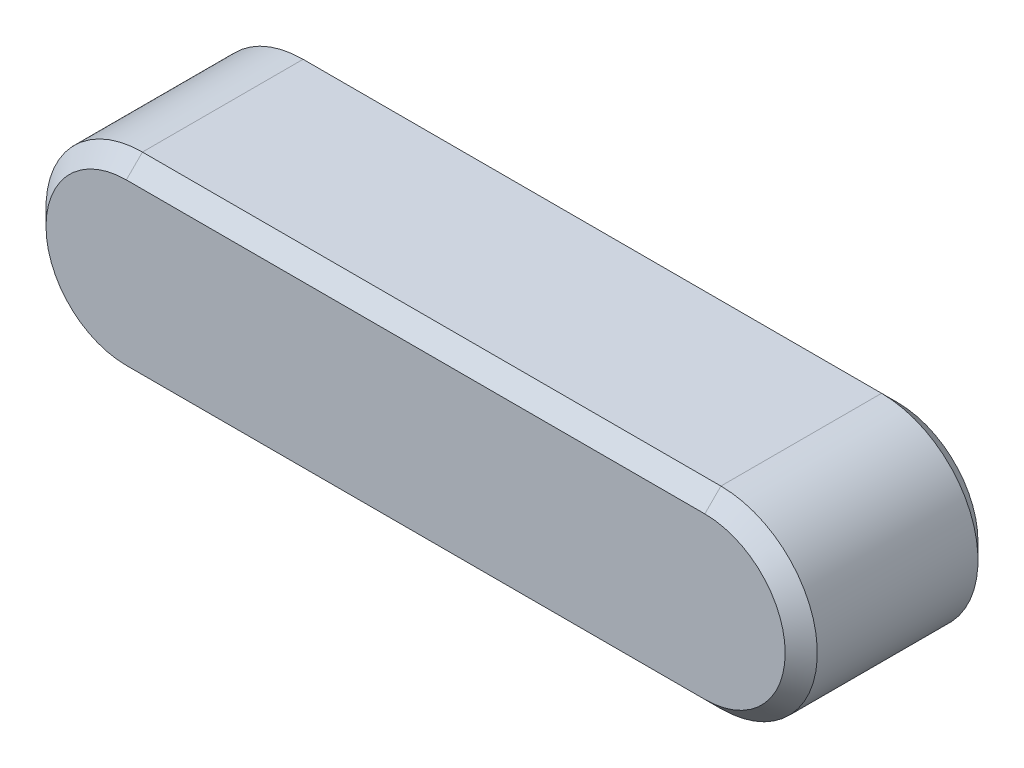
ISO-10303-21;
HEADER;
FILE_DESCRIPTION(('STEP AP214'),'2;1');
FILE_NAME('part.step','',(''),(''),'','','');
FILE_SCHEMA(('AUTOMOTIVE_DESIGN { 1 0 10303 214 1 1 1 1 }'));
ENDSEC;
DATA;
#1=APPLICATION_CONTEXT('core data for automotive mechanical design processes');
#2=APPLICATION_PROTOCOL_DEFINITION('international standard','automotive_design',2000,#1);
#3=PRODUCT_CONTEXT('',#1,'mechanical');
#4=PRODUCT('Part','Part','',(#3));
#5=PRODUCT_RELATED_PRODUCT_CATEGORY('part','',(#4));
#6=PRODUCT_DEFINITION_FORMATION('','',#4);
#7=PRODUCT_DEFINITION_CONTEXT('part definition',#1,'design');
#8=PRODUCT_DEFINITION('design','',#6,#7);
#9=PRODUCT_DEFINITION_SHAPE('','',#8);
#10=(LENGTH_UNIT() NAMED_UNIT(*) SI_UNIT(.MILLI.,.METRE.));
#11=(NAMED_UNIT(*) PLANE_ANGLE_UNIT() SI_UNIT($,.RADIAN.));
#12=(NAMED_UNIT(*) SI_UNIT($,.STERADIAN.) SOLID_ANGLE_UNIT());
#13=UNCERTAINTY_MEASURE_WITH_UNIT(LENGTH_MEASURE(1.E-05),#10,'distance_accuracy_value','');
#14=(GEOMETRIC_REPRESENTATION_CONTEXT(3) GLOBAL_UNCERTAINTY_ASSIGNED_CONTEXT((#13)) GLOBAL_UNIT_ASSIGNED_CONTEXT((#10,
#11,#12)) REPRESENTATION_CONTEXT('',''));
#15=CARTESIAN_POINT('',(0.,0.,0.));
#16=DIRECTION('',(0.,0.,1.));
#17=DIRECTION('',(1.,0.,0.));
#18=AXIS2_PLACEMENT_3D('',#15,#16,#17);
#19=CARTESIAN_POINT('',(-305.461782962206,426.327731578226,6.));
#20=DIRECTION('',(0.,0.,-1.));
#21=DIRECTION('',(-1.,0.,0.));
#22=AXIS2_PLACEMENT_3D('',#19,#20,#21);
#23=CYLINDRICAL_SURFACE('',#22,3.00000000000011);
#24=DIRECTION('',(0.,0.,-1.));
#25=VECTOR('',#24,1.);
#26=CARTESIAN_POINT('',(-305.461782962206,423.327731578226,6.));
#27=LINE('',#26,#25);
#28=CARTESIAN_POINT('',(-305.461782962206,423.327731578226,5.49999999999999));
#29=VERTEX_POINT('',#28);
#30=CARTESIAN_POINT('',(-305.461782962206,423.327731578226,0.499999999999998));
#31=VERTEX_POINT('',#30);
#32=EDGE_CURVE('E120',#29,#31,#27,.T.);
#33=ORIENTED_EDGE('',*,*,#32,.F.);
#34=CARTESIAN_POINT('',(-305.461782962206,426.327731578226,5.49999999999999));
#35=DIRECTION('',(0.,0.,1.));
#36=DIRECTION('',(1.,0.,0.));
#37=AXIS2_PLACEMENT_3D('',#34,#35,#36);
#38=CIRCLE('',#37,3.00000000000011);
#39=CARTESIAN_POINT('',(-305.461782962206,429.327731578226,5.49999999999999));
#40=VERTEX_POINT('',#39);
#41=EDGE_CURVE('E151',#29,#40,#38,.F.);
#42=ORIENTED_EDGE('',*,*,#41,.T.);
#43=DIRECTION('',(0.,0.,-1.));
#44=VECTOR('',#43,1.);
#45=CARTESIAN_POINT('',(-305.461782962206,429.327731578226,6.));
#46=LINE('',#45,#44);
#47=CARTESIAN_POINT('',(-305.461782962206,429.327731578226,0.499999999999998));
#48=VERTEX_POINT('',#47);
#49=EDGE_CURVE('E126',#40,#48,#46,.T.);
#50=ORIENTED_EDGE('',*,*,#49,.T.);
#51=CARTESIAN_POINT('',(-305.461782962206,426.327731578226,0.499999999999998));
#52=DIRECTION('',(0.,0.,1.));
#53=DIRECTION('',(1.,0.,0.));
#54=AXIS2_PLACEMENT_3D('',#51,#52,#53);
#55=CIRCLE('',#54,3.00000000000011);
#56=EDGE_CURVE('E153',#48,#31,#55,.T.);
#57=ORIENTED_EDGE('',*,*,#56,.T.);
#58=EDGE_LOOP('',(#33,#42,#50,#57));
#59=FACE_BOUND('',#58,.T.);
#60=ADVANCED_FACE('F32',(#59),#23,.T.);
#61=CARTESIAN_POINT('',(-287.461782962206,423.327731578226,6.));
#62=DIRECTION('',(0.,1.,0.));
#63=DIRECTION('',(0.,0.,1.));
#64=AXIS2_PLACEMENT_3D('',#61,#62,#63);
#65=PLANE('',#64);
#66=DIRECTION('',(0.,0.,-1.));
#67=VECTOR('',#66,1.);
#68=CARTESIAN_POINT('',(-287.461782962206,423.327731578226,6.));
#69=LINE('',#68,#67);
#70=CARTESIAN_POINT('',(-287.461782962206,423.327731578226,5.49999999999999));
#71=VERTEX_POINT('',#70);
#72=CARTESIAN_POINT('',(-287.461782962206,423.327731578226,0.499999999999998));
#73=VERTEX_POINT('',#72);
#74=EDGE_CURVE('E172',#71,#73,#69,.T.);
#75=ORIENTED_EDGE('',*,*,#74,.F.);
#76=DIRECTION('',(-1.,0.,0.));
#77=VECTOR('',#76,1.);
#78=CARTESIAN_POINT('',(-305.461782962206,423.327731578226,5.49999999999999));
#79=LINE('',#78,#77);
#80=EDGE_CURVE('E155',#71,#29,#79,.T.);
#81=ORIENTED_EDGE('',*,*,#80,.T.);
#82=ORIENTED_EDGE('',*,*,#32,.T.);
#83=DIRECTION('',(1.,0.,0.));
#84=VECTOR('',#83,1.);
#85=CARTESIAN_POINT('',(-287.461782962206,423.327731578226,0.499999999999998));
#86=LINE('',#85,#84);
#87=EDGE_CURVE('E157',#31,#73,#86,.T.);
#88=ORIENTED_EDGE('',*,*,#87,.T.);
#89=EDGE_LOOP('',(#75,#81,#82,#88));
#90=FACE_BOUND('',#89,.T.);
#91=ADVANCED_FACE('F189',(#90),#65,.F.);
#92=CARTESIAN_POINT('',(-287.461782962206,426.327731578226,6.));
#93=DIRECTION('',(0.,0.,-1.));
#94=DIRECTION('',(-1.,0.,0.));
#95=AXIS2_PLACEMENT_3D('',#92,#93,#94);
#96=CYLINDRICAL_SURFACE('',#95,3.00000000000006);
#97=DIRECTION('',(0.,0.,-1.));
#98=VECTOR('',#97,1.);
#99=CARTESIAN_POINT('',(-287.461782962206,429.327731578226,6.));
#100=LINE('',#99,#98);
#101=CARTESIAN_POINT('',(-287.461782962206,429.327731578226,5.49999999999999));
#102=VERTEX_POINT('',#101);
#103=CARTESIAN_POINT('',(-287.461782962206,429.327731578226,0.499999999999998));
#104=VERTEX_POINT('',#103);
#105=EDGE_CURVE('E175',#102,#104,#100,.T.);
#106=ORIENTED_EDGE('',*,*,#105,.F.);
#107=CARTESIAN_POINT('',(-287.461782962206,426.327731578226,5.49999999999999));
#108=DIRECTION('',(0.,0.,1.));
#109=DIRECTION('',(1.,0.,0.));
#110=AXIS2_PLACEMENT_3D('',#107,#108,#109);
#111=CIRCLE('',#110,3.00000000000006);
#112=EDGE_CURVE('E162',#102,#71,#111,.F.);
#113=ORIENTED_EDGE('',*,*,#112,.T.);
#114=ORIENTED_EDGE('',*,*,#74,.T.);
#115=CARTESIAN_POINT('',(-287.461782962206,426.327731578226,0.499999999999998));
#116=DIRECTION('',(0.,0.,1.));
#117=DIRECTION('',(1.,0.,0.));
#118=AXIS2_PLACEMENT_3D('',#115,#116,#117);
#119=CIRCLE('',#118,3.00000000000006);
#120=EDGE_CURVE('E165',#73,#104,#119,.T.);
#121=ORIENTED_EDGE('',*,*,#120,.T.);
#122=EDGE_LOOP('',(#106,#113,#114,#121));
#123=FACE_BOUND('',#122,.T.);
#124=ADVANCED_FACE('F192',(#123),#96,.T.);
#125=CARTESIAN_POINT('',(-305.461782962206,429.327731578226,6.));
#126=DIRECTION('',(0.,-1.,0.));
#127=DIRECTION('',(1.,0.,0.));
#128=AXIS2_PLACEMENT_3D('',#125,#126,#127);
#129=PLANE('',#128);
#130=ORIENTED_EDGE('',*,*,#49,.F.);
#131=DIRECTION('',(1.,0.,0.));
#132=VECTOR('',#131,1.);
#133=CARTESIAN_POINT('',(-287.461782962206,429.327731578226,5.49999999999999));
#134=LINE('',#133,#132);
#135=EDGE_CURVE('E123',#40,#102,#134,.T.);
#136=ORIENTED_EDGE('',*,*,#135,.T.);
#137=ORIENTED_EDGE('',*,*,#105,.T.);
#138=DIRECTION('',(-1.,0.,0.));
#139=VECTOR('',#138,1.);
#140=CARTESIAN_POINT('',(-305.461782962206,429.327731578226,0.499999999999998));
#141=LINE('',#140,#139);
#142=EDGE_CURVE('E160',#104,#48,#141,.T.);
#143=ORIENTED_EDGE('',*,*,#142,.T.);
#144=EDGE_LOOP('',(#130,#136,#137,#143));
#145=FACE_BOUND('',#144,.T.);
#146=ADVANCED_FACE('F281',(#145),#129,.F.);
#147=CARTESIAN_POINT('',(-305.461782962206,426.327731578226,6.));
#148=DIRECTION('',(0.,0.,1.));
#149=DIRECTION('',(1.,0.,0.));
#150=AXIS2_PLACEMENT_3D('',#147,#148,#149);
#151=PLANE('',#150);
#152=DIRECTION('',(1.,0.,0.));
#153=VECTOR('',#152,1.);
#154=CARTESIAN_POINT('',(-287.461782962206,423.827731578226,6.));
#155=LINE('',#154,#153);
#156=CARTESIAN_POINT('',(-305.461782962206,423.827731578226,6.));
#157=VERTEX_POINT('',#156);
#158=CARTESIAN_POINT('',(-287.461782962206,423.827731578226,6.));
#159=VERTEX_POINT('',#158);
#160=EDGE_CURVE('E109',#157,#159,#155,.T.);
#161=ORIENTED_EDGE('',*,*,#160,.T.);
#162=CARTESIAN_POINT('',(-287.461782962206,426.327731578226,6.));
#163=DIRECTION('',(0.,0.,1.));
#164=DIRECTION('',(1.,0.,0.));
#165=AXIS2_PLACEMENT_3D('',#162,#163,#164);
#166=CIRCLE('',#165,2.50000000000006);
#167=CARTESIAN_POINT('',(-287.461782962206,428.827731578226,6.));
#168=VERTEX_POINT('',#167);
#169=EDGE_CURVE('E105',#159,#168,#166,.T.);
#170=ORIENTED_EDGE('',*,*,#169,.T.);
#171=DIRECTION('',(-1.,0.,0.));
#172=VECTOR('',#171,1.);
#173=CARTESIAN_POINT('',(-305.461782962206,428.827731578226,6.));
#174=LINE('',#173,#172);
#175=CARTESIAN_POINT('',(-305.461782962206,428.827731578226,6.));
#176=VERTEX_POINT('',#175);
#177=EDGE_CURVE('E99',#168,#176,#174,.T.);
#178=ORIENTED_EDGE('',*,*,#177,.T.);
#179=CARTESIAN_POINT('',(-305.461782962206,426.327731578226,6.));
#180=DIRECTION('',(0.,0.,1.));
#181=DIRECTION('',(1.,0.,0.));
#182=AXIS2_PLACEMENT_3D('',#179,#180,#181);
#183=CIRCLE('',#182,2.50000000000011);
#184=EDGE_CURVE('E102',#176,#157,#183,.T.);
#185=ORIENTED_EDGE('',*,*,#184,.T.);
#186=EDGE_LOOP('',(#161,#170,#178,#185));
#187=FACE_BOUND('',#186,.T.);
#188=ADVANCED_FACE('F101',(#187),#151,.T.);
#189=CARTESIAN_POINT('',(-305.461782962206,426.327731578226,0.));
#190=DIRECTION('',(0.,0.,1.));
#191=DIRECTION('',(1.,0.,0.));
#192=AXIS2_PLACEMENT_3D('',#189,#190,#191);
#193=PLANE('',#192);
#194=DIRECTION('',(1.,0.,0.));
#195=VECTOR('',#194,1.);
#196=CARTESIAN_POINT('',(-305.461782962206,428.827731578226,0.));
#197=LINE('',#196,#195);
#198=CARTESIAN_POINT('',(-305.461782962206,428.827731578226,0.));
#199=VERTEX_POINT('',#198);
#200=CARTESIAN_POINT('',(-287.461782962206,428.827731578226,0.));
#201=VERTEX_POINT('',#200);
#202=EDGE_CURVE('E41',#199,#201,#197,.T.);
#203=ORIENTED_EDGE('',*,*,#202,.T.);
#204=CARTESIAN_POINT('',(-287.461782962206,426.327731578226,0.));
#205=DIRECTION('',(0.,0.,1.));
#206=DIRECTION('',(1.,0.,0.));
#207=AXIS2_PLACEMENT_3D('',#204,#205,#206);
#208=CIRCLE('',#207,2.50000000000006);
#209=CARTESIAN_POINT('',(-287.461782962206,423.827731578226,0.));
#210=VERTEX_POINT('',#209);
#211=EDGE_CURVE('E11',#201,#210,#208,.F.);
#212=ORIENTED_EDGE('',*,*,#211,.T.);
#213=DIRECTION('',(-1.,0.,0.));
#214=VECTOR('',#213,1.);
#215=CARTESIAN_POINT('',(-305.461782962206,423.827731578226,0.));
#216=LINE('',#215,#214);
#217=CARTESIAN_POINT('',(-305.461782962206,423.827731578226,0.));
#218=VERTEX_POINT('',#217);
#219=EDGE_CURVE('E147',#210,#218,#216,.T.);
#220=ORIENTED_EDGE('',*,*,#219,.T.);
#221=CARTESIAN_POINT('',(-305.461782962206,426.327731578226,0.));
#222=DIRECTION('',(0.,0.,1.));
#223=DIRECTION('',(1.,0.,0.));
#224=AXIS2_PLACEMENT_3D('',#221,#222,#223);
#225=CIRCLE('',#224,2.50000000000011);
#226=EDGE_CURVE('E149',#218,#199,#225,.F.);
#227=ORIENTED_EDGE('',*,*,#226,.T.);
#228=EDGE_LOOP('',(#203,#212,#220,#227));
#229=FACE_BOUND('',#228,.T.);
#230=ADVANCED_FACE('F205',(#229),#193,.F.);
#231=CARTESIAN_POINT('',(-305.461782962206,426.327731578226,6.));
#232=DIRECTION('',(0.,0.,-1.));
#233=DIRECTION('',(-1.,0.,0.));
#234=AXIS2_PLACEMENT_3D('',#231,#232,#233);
#235=CONICAL_SURFACE('',#234,2.50000000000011,0.785398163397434);
#236=DIRECTION('',(0.,-0.707106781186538,0.707106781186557));
#237=VECTOR('',#236,1.);
#238=CARTESIAN_POINT('',(-305.461782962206,429.327731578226,5.49999999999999));
#239=LINE('',#238,#237);
#240=EDGE_CURVE('E115',#40,#176,#239,.T.);
#241=ORIENTED_EDGE('',*,*,#240,.F.);
#242=ORIENTED_EDGE('',*,*,#41,.F.);
#243=DIRECTION('',(0.,-0.707106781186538,-0.707106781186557));
#244=VECTOR('',#243,1.);
#245=CARTESIAN_POINT('',(-305.461782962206,423.827731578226,6.));
#246=LINE('',#245,#244);
#247=EDGE_CURVE('E118',#157,#29,#246,.T.);
#248=ORIENTED_EDGE('',*,*,#247,.F.);
#249=ORIENTED_EDGE('',*,*,#184,.F.);
#250=EDGE_LOOP('',(#241,#242,#248,#249));
#251=FACE_BOUND('',#250,.T.);
#252=ADVANCED_FACE('F113',(#251),#235,.T.);
#253=CARTESIAN_POINT('',(-305.461782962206,423.827731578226,6.));
#254=DIRECTION('',(0.,-0.707106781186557,0.707106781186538));
#255=DIRECTION('',(0.,-0.707106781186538,-0.707106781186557));
#256=AXIS2_PLACEMENT_3D('',#253,#254,#255);
#257=PLANE('',#256);
#258=ORIENTED_EDGE('',*,*,#247,.T.);
#259=ORIENTED_EDGE('',*,*,#80,.F.);
#260=DIRECTION('',(0.,-0.707106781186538,-0.707106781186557));
#261=VECTOR('',#260,1.);
#262=CARTESIAN_POINT('',(-287.461782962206,423.827731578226,6.));
#263=LINE('',#262,#261);
#264=EDGE_CURVE('E124',#159,#71,#263,.T.);
#265=ORIENTED_EDGE('',*,*,#264,.F.);
#266=ORIENTED_EDGE('',*,*,#160,.F.);
#267=EDGE_LOOP('',(#258,#259,#265,#266));
#268=FACE_BOUND('',#267,.T.);
#269=ADVANCED_FACE('F197',(#268),#257,.T.);
#270=CARTESIAN_POINT('',(-305.461782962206,428.827731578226,6.));
#271=DIRECTION('',(0.,0.707106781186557,0.707106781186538));
#272=DIRECTION('',(0.,-0.707106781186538,0.707106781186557));
#273=AXIS2_PLACEMENT_3D('',#270,#271,#272);
#274=PLANE('',#273);
#275=ORIENTED_EDGE('',*,*,#240,.T.);
#276=ORIENTED_EDGE('',*,*,#177,.F.);
#277=DIRECTION('',(0.,-0.707106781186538,0.707106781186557));
#278=VECTOR('',#277,1.);
#279=CARTESIAN_POINT('',(-287.461782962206,429.327731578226,5.49999999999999));
#280=LINE('',#279,#278);
#281=EDGE_CURVE('E128',#102,#168,#280,.T.);
#282=ORIENTED_EDGE('',*,*,#281,.F.);
#283=ORIENTED_EDGE('',*,*,#135,.F.);
#284=EDGE_LOOP('',(#275,#276,#282,#283));
#285=FACE_BOUND('',#284,.T.);
#286=ADVANCED_FACE('F122',(#285),#274,.T.);
#287=CARTESIAN_POINT('',(-287.461782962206,426.327731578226,6.));
#288=DIRECTION('',(0.,0.,-1.));
#289=DIRECTION('',(-1.,0.,0.));
#290=AXIS2_PLACEMENT_3D('',#287,#288,#289);
#291=CONICAL_SURFACE('',#290,2.50000000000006,0.785398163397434);
#292=ORIENTED_EDGE('',*,*,#264,.T.);
#293=ORIENTED_EDGE('',*,*,#112,.F.);
#294=ORIENTED_EDGE('',*,*,#281,.T.);
#295=ORIENTED_EDGE('',*,*,#169,.F.);
#296=EDGE_LOOP('',(#292,#293,#294,#295));
#297=FACE_BOUND('',#296,.T.);
#298=ADVANCED_FACE('F193',(#297),#291,.T.);
#299=CARTESIAN_POINT('',(-305.461782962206,426.327731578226,0.499999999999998));
#300=DIRECTION('',(0.,0.,1.));
#301=DIRECTION('',(1.,0.,0.));
#302=AXIS2_PLACEMENT_3D('',#299,#300,#301);
#303=CONICAL_SURFACE('',#302,3.00000000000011,0.785398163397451);
#304=DIRECTION('',(0.,0.707106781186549,0.707106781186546));
#305=VECTOR('',#304,1.);
#306=CARTESIAN_POINT('',(-305.461782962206,428.827731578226,0.));
#307=LINE('',#306,#305);
#308=EDGE_CURVE('E134',#199,#48,#307,.T.);
#309=ORIENTED_EDGE('',*,*,#308,.F.);
#310=ORIENTED_EDGE('',*,*,#226,.F.);
#311=DIRECTION('',(0.,0.707106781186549,-0.707106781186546));
#312=VECTOR('',#311,1.);
#313=CARTESIAN_POINT('',(-305.461782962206,423.327731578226,0.499999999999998));
#314=LINE('',#313,#312);
#315=EDGE_CURVE('E36',#31,#218,#314,.T.);
#316=ORIENTED_EDGE('',*,*,#315,.F.);
#317=ORIENTED_EDGE('',*,*,#56,.F.);
#318=EDGE_LOOP('',(#309,#310,#316,#317));
#319=FACE_BOUND('',#318,.T.);
#320=ADVANCED_FACE('F34',(#319),#303,.T.);
#321=CARTESIAN_POINT('',(-287.461782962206,423.327731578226,0.499999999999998));
#322=DIRECTION('',(0.,0.707106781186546,0.707106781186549));
#323=DIRECTION('',(0.,-0.707106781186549,0.707106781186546));
#324=AXIS2_PLACEMENT_3D('',#321,#322,#323);
#325=PLANE('',#324);
#326=ORIENTED_EDGE('',*,*,#315,.T.);
#327=ORIENTED_EDGE('',*,*,#219,.F.);
#328=DIRECTION('',(0.,0.707106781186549,-0.707106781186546));
#329=VECTOR('',#328,1.);
#330=CARTESIAN_POINT('',(-287.461782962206,423.327731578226,0.499999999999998));
#331=LINE('',#330,#329);
#332=EDGE_CURVE('E54',#73,#210,#331,.T.);
#333=ORIENTED_EDGE('',*,*,#332,.F.);
#334=ORIENTED_EDGE('',*,*,#87,.F.);
#335=EDGE_LOOP('',(#326,#327,#333,#334));
#336=FACE_BOUND('',#335,.T.);
#337=ADVANCED_FACE('F186',(#336),#325,.F.);
#338=CARTESIAN_POINT('',(-305.461782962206,429.327731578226,0.499999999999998));
#339=DIRECTION('',(0.,-0.707106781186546,0.707106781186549));
#340=DIRECTION('',(0.,-0.707106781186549,-0.707106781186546));
#341=AXIS2_PLACEMENT_3D('',#338,#339,#340);
#342=PLANE('',#341);
#343=ORIENTED_EDGE('',*,*,#308,.T.);
#344=ORIENTED_EDGE('',*,*,#142,.F.);
#345=DIRECTION('',(0.,0.707106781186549,0.707106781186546));
#346=VECTOR('',#345,1.);
#347=CARTESIAN_POINT('',(-287.461782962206,428.827731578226,0.));
#348=LINE('',#347,#346);
#349=EDGE_CURVE('E132',#201,#104,#348,.T.);
#350=ORIENTED_EDGE('',*,*,#349,.F.);
#351=ORIENTED_EDGE('',*,*,#202,.F.);
#352=EDGE_LOOP('',(#343,#344,#350,#351));
#353=FACE_BOUND('',#352,.T.);
#354=ADVANCED_FACE('F222',(#353),#342,.F.);
#355=CARTESIAN_POINT('',(-287.461782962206,426.327731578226,0.499999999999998));
#356=DIRECTION('',(0.,0.,1.));
#357=DIRECTION('',(1.,0.,0.));
#358=AXIS2_PLACEMENT_3D('',#355,#356,#357);
#359=CONICAL_SURFACE('',#358,3.00000000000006,0.785398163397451);
#360=ORIENTED_EDGE('',*,*,#332,.T.);
#361=ORIENTED_EDGE('',*,*,#211,.F.);
#362=ORIENTED_EDGE('',*,*,#349,.T.);
#363=ORIENTED_EDGE('',*,*,#120,.F.);
#364=EDGE_LOOP('',(#360,#361,#362,#363));
#365=FACE_BOUND('',#364,.T.);
#366=ADVANCED_FACE('F226',(#365),#359,.T.);
#367=CLOSED_SHELL('',(#60,#91,#124,#146,#188,#230,#252,#269,#286,#298,#320,#337,#354,#366));
#368=MANIFOLD_SOLID_BREP('B2',#367);
#369=ADVANCED_BREP_SHAPE_REPRESENTATION('',(#18,#368),#14);
#370=SHAPE_DEFINITION_REPRESENTATION(#9,#369);
ENDSEC;
END-ISO-10303-21;
